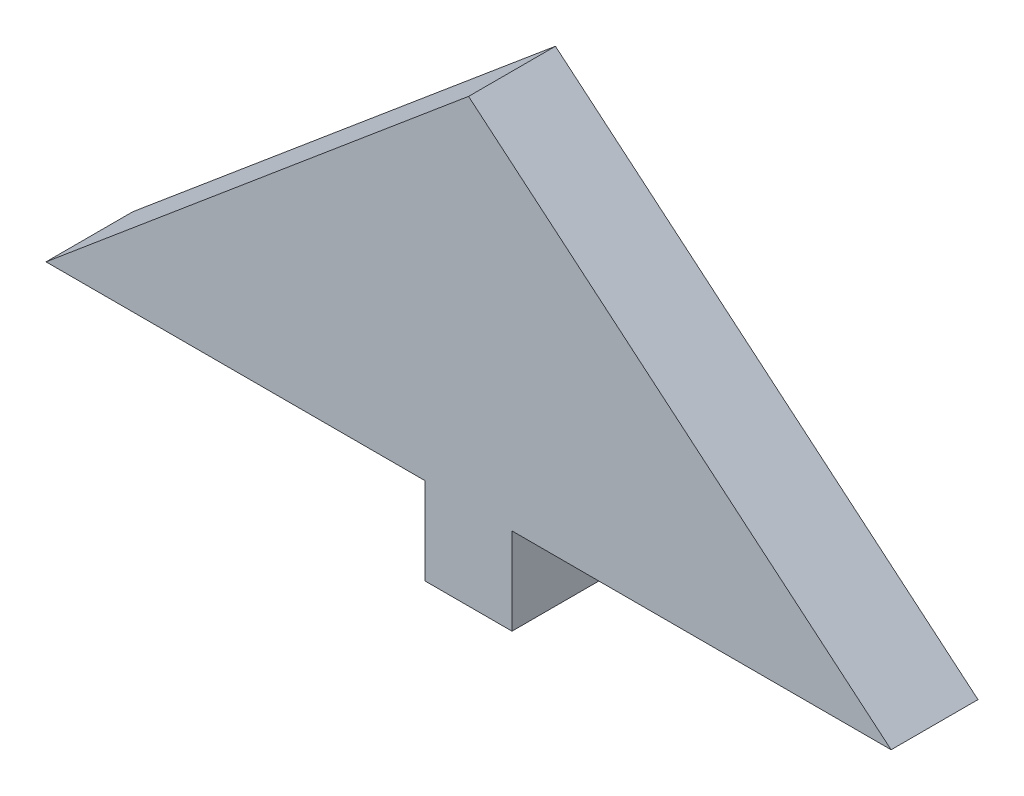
from build123d import *

# Parameters (mm, degrees)
SKETCH1_W           = 3
SKETCH1_H           = 3
BOSS_EXTRUDE1_DEPTH = 1.5


with BuildPart() as part:
    # Sketch1 → Boss-Extrude1 (new, symmetric)
    with BuildSketch(Plane.XY):
        with Locations((0, 1.5)):
            Rectangle(SKETCH1_W, SKETCH1_H)
        Polygon((14.593146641, 3), (-14.593146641, 3), (0, 15.245103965), align=None)
    extrude(amount=BOSS_EXTRUDE1_DEPTH, both=True)


solid = part.part
